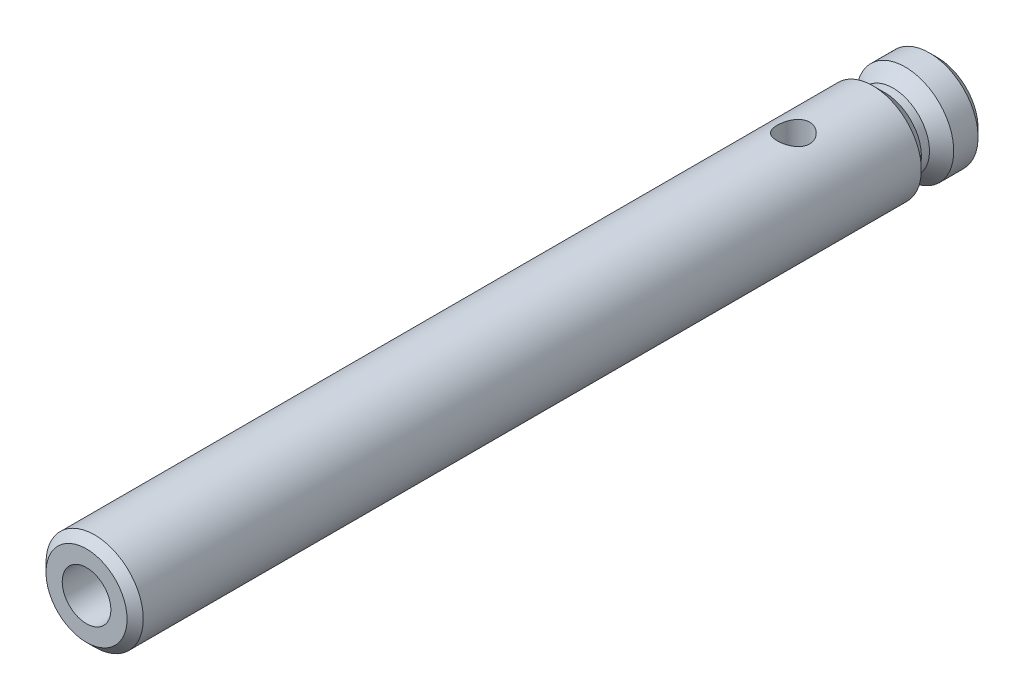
ISO-10303-21;
HEADER;
FILE_DESCRIPTION(('STEP AP214'),'2;1');
FILE_NAME('part.step','',(''),(''),'','','');
FILE_SCHEMA(('AUTOMOTIVE_DESIGN { 1 0 10303 214 1 1 1 1 }'));
ENDSEC;
DATA;
#1=APPLICATION_CONTEXT('core data for automotive mechanical design processes');
#2=APPLICATION_PROTOCOL_DEFINITION('international standard','automotive_design',2000,#1);
#3=PRODUCT_CONTEXT('',#1,'mechanical');
#4=PRODUCT('Part','Part','',(#3));
#5=PRODUCT_RELATED_PRODUCT_CATEGORY('part','',(#4));
#6=PRODUCT_DEFINITION_FORMATION('','',#4);
#7=PRODUCT_DEFINITION_CONTEXT('part definition',#1,'design');
#8=PRODUCT_DEFINITION('design','',#6,#7);
#9=PRODUCT_DEFINITION_SHAPE('','',#8);
#10=(LENGTH_UNIT() NAMED_UNIT(*) SI_UNIT(.MILLI.,.METRE.));
#11=(NAMED_UNIT(*) PLANE_ANGLE_UNIT() SI_UNIT($,.RADIAN.));
#12=(NAMED_UNIT(*) SI_UNIT($,.STERADIAN.) SOLID_ANGLE_UNIT());
#13=UNCERTAINTY_MEASURE_WITH_UNIT(LENGTH_MEASURE(1.E-05),#10,'distance_accuracy_value','');
#14=(GEOMETRIC_REPRESENTATION_CONTEXT(3) GLOBAL_UNCERTAINTY_ASSIGNED_CONTEXT((#13)) GLOBAL_UNIT_ASSIGNED_CONTEXT((#10,
#11,#12)) REPRESENTATION_CONTEXT('',''));
#15=CARTESIAN_POINT('',(0.,0.,0.));
#16=DIRECTION('',(0.,0.,1.));
#17=DIRECTION('',(1.,0.,0.));
#18=AXIS2_PLACEMENT_3D('',#15,#16,#17);
#19=CARTESIAN_POINT('',(0.,-185.427795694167,87.2095831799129));
#20=DIRECTION('',(0.,0.,-1.));
#21=DIRECTION('',(-1.,0.,0.));
#22=AXIS2_PLACEMENT_3D('',#19,#20,#21);
#23=CYLINDRICAL_SURFACE('',#22,3.);
#24=CARTESIAN_POINT('',(0.,-185.427795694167,72.2095831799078));
#25=DIRECTION('',(0.,0.,-1.));
#26=DIRECTION('',(-1.,0.,0.));
#27=AXIS2_PLACEMENT_3D('',#24,#25,#26);
#28=CIRCLE('',#27,3.);
#29=CARTESIAN_POINT('',(-3.,-185.427795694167,72.2095831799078));
#30=VERTEX_POINT('',#29);
#31=EDGE_CURVE('E55',#30,#30,#28,.T.);
#32=ORIENTED_EDGE('',*,*,#31,.T.);
#33=EDGE_LOOP('',(#32));
#34=FACE_BOUND('',#33,.T.);
#35=CARTESIAN_POINT('',(0.,-185.427795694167,87.2095831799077));
#36=DIRECTION('',(0.,0.,-1.));
#37=DIRECTION('',(-1.,0.,0.));
#38=AXIS2_PLACEMENT_3D('',#35,#36,#37);
#39=CIRCLE('',#38,3.);
#40=CARTESIAN_POINT('',(-3.,-185.427795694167,87.2095831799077));
#41=VERTEX_POINT('',#40);
#42=EDGE_CURVE('E117',#41,#41,#39,.T.);
#43=ORIENTED_EDGE('',*,*,#42,.F.);
#44=EDGE_LOOP('',(#43));
#45=FACE_BOUND('',#44,.T.);
#46=ADVANCED_FACE('F28',(#34,#45),#23,.F.);
#47=CARTESIAN_POINT('',(3.,-185.427795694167,87.2095831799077));
#48=DIRECTION('',(0.,0.,1.));
#49=DIRECTION('',(1.,0.,0.));
#50=AXIS2_PLACEMENT_3D('',#47,#48,#49);
#51=PLANE('',#50);
#52=CARTESIAN_POINT('',(0.,-185.427795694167,87.2095831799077));
#53=DIRECTION('',(0.,0.,1.));
#54=DIRECTION('',(1.,0.,0.));
#55=AXIS2_PLACEMENT_3D('',#52,#53,#54);
#56=CIRCLE('',#55,5.00000000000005);
#57=CARTESIAN_POINT('',(5.00000000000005,-185.427795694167,87.2095831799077));
#58=VERTEX_POINT('',#57);
#59=EDGE_CURVE('E10',#58,#58,#56,.T.);
#60=ORIENTED_EDGE('',*,*,#59,.T.);
#61=EDGE_LOOP('',(#60));
#62=FACE_BOUND('',#61,.T.);
#63=ORIENTED_EDGE('',*,*,#42,.T.);
#64=EDGE_LOOP('',(#63));
#65=FACE_BOUND('',#64,.T.);
#66=ADVANCED_FACE('F104',(#62,#65),#51,.T.);
#67=CARTESIAN_POINT('',(0.,-185.427795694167,87.2095831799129));
#68=DIRECTION('',(0.,0.,-1.));
#69=DIRECTION('',(-1.,0.,0.));
#70=AXIS2_PLACEMENT_3D('',#67,#68,#69);
#71=CYLINDRICAL_SURFACE('',#70,6.00000000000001);
#72=CARTESIAN_POINT('',(0.,-185.427795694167,86.2095831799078));
#73=DIRECTION('',(0.,0.,1.));
#74=DIRECTION('',(1.,0.,0.));
#75=AXIS2_PLACEMENT_3D('',#72,#73,#74);
#76=CIRCLE('',#75,6.00000000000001);
#77=CARTESIAN_POINT('',(6.00000000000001,-185.427795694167,86.2095831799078));
#78=VERTEX_POINT('',#77);
#79=EDGE_CURVE('E34',#78,#78,#76,.F.);
#80=ORIENTED_EDGE('',*,*,#79,.T.);
#81=EDGE_LOOP('',(#80));
#82=FACE_BOUND('',#81,.T.);
#83=CARTESIAN_POINT('',(0.,-179.427795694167,2.));
#84=CARTESIAN_POINT('',(0.109126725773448,-179.427795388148,2.00000050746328));
#85=CARTESIAN_POINT('',(0.218250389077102,-179.430800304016,1.99103946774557));
#86=CARTESIAN_POINT('',(0.433283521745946,-179.442491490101,1.95554178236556));
#87=CARTESIAN_POINT('',(0.539192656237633,-179.451178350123,1.92900331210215));
#88=CARTESIAN_POINT('',(0.744665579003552,-179.473289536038,1.8593615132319));
#89=CARTESIAN_POINT('',(0.844239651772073,-179.486705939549,1.81628587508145));
#90=CARTESIAN_POINT('',(1.03474987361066,-179.51690677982,1.7149176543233));
#91=CARTESIAN_POINT('',(1.12568431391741,-179.533691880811,1.6566220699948));
#92=CARTESIAN_POINT('',(1.29948335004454,-179.569513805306,1.52434839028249));
#93=CARTESIAN_POINT('',(1.38200740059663,-179.588604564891,1.449937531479));
#94=CARTESIAN_POINT('',(1.53366538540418,-179.626589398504,1.28846569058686));
#95=CARTESIAN_POINT('',(1.60279637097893,-179.645483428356,1.20140193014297));
#96=CARTESIAN_POINT('',(1.72764988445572,-179.681529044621,1.01402976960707));
#97=CARTESIAN_POINT('',(1.78292971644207,-179.698614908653,0.913412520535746));
#98=CARTESIAN_POINT('',(1.87563774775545,-179.728289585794,0.703647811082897));
#99=CARTESIAN_POINT('',(1.91307139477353,-179.740879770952,0.594502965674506));
#100=CARTESIAN_POINT('',(1.96774692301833,-179.759569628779,0.374653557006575));
#101=CARTESIAN_POINT('',(1.98562689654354,-179.765873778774,0.264125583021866));
#102=CARTESIAN_POINT('',(2.00268224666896,-179.771882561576,0.0414724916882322));
#103=CARTESIAN_POINT('',(2.00186340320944,-179.771589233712,-0.0706521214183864));
#104=CARTESIAN_POINT('',(1.98203980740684,-179.764615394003,-0.287873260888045));
#105=CARTESIAN_POINT('',(1.96386782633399,-179.758227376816,-0.393056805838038));
#106=CARTESIAN_POINT('',(1.91121232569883,-179.740262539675,-0.59878683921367));
#107=CARTESIAN_POINT('',(1.87672685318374,-179.728685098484,-0.699332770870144));
#108=CARTESIAN_POINT('',(1.79187811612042,-179.701437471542,-0.894825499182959));
#109=CARTESIAN_POINT('',(1.74126809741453,-179.685704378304,-0.989656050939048));
#110=CARTESIAN_POINT('',(1.62577821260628,-179.651944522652,-1.16974181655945));
#111=CARTESIAN_POINT('',(1.56089422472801,-179.633917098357,-1.25499425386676));
#112=CARTESIAN_POINT('',(1.41469866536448,-179.596449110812,-1.41818319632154));
#113=CARTESIAN_POINT('',(1.33270630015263,-179.57698390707,-1.49550538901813));
#114=CARTESIAN_POINT('',(1.15667913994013,-179.539656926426,-1.63546253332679));
#115=CARTESIAN_POINT('',(1.06264319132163,-179.521795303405,-1.69809607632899));
#116=CARTESIAN_POINT('',(0.863895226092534,-179.489453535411,-1.80739260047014));
#117=CARTESIAN_POINT('',(0.759086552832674,-179.475008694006,-1.85389098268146));
#118=CARTESIAN_POINT('',(0.542538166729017,-179.451384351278,-1.92840634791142));
#119=CARTESIAN_POINT('',(0.430800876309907,-179.442203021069,-1.95642975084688));
#120=CARTESIAN_POINT('',(0.208767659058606,-179.430443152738,-1.99211133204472));
#121=CARTESIAN_POINT('',(0.0986191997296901,-179.427595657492,-2.0005996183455));
#122=CARTESIAN_POINT('',(-0.121550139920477,-179.42801764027,-1.99933465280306));
#123=CARTESIAN_POINT('',(-0.231571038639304,-179.431286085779,-1.98958448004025));
#124=CARTESIAN_POINT('',(-0.445039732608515,-179.443395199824,-1.95277618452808));
#125=CARTESIAN_POINT('',(-0.548585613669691,-179.452071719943,-1.92622758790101));
#126=CARTESIAN_POINT('',(-0.749711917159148,-179.473958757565,-1.85721311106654));
#127=CARTESIAN_POINT('',(-0.847291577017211,-179.487169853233,-1.81474520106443));
#128=CARTESIAN_POINT('',(-1.03657659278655,-179.517217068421,-1.71385913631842));
#129=CARTESIAN_POINT('',(-1.1280599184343,-179.534139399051,-1.65505081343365));
#130=CARTESIAN_POINT('',(-1.30012966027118,-179.569690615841,-1.52361169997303));
#131=CARTESIAN_POINT('',(-1.38071273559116,-179.58832002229,-1.45097668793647));
#132=CARTESIAN_POINT('',(-1.5325050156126,-179.626258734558,-1.29004249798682));
#133=CARTESIAN_POINT('',(-1.60312193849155,-179.645560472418,-1.20118154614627));
#134=CARTESIAN_POINT('',(-1.72851504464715,-179.681796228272,-1.01245686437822));
#135=CARTESIAN_POINT('',(-1.78329109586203,-179.698730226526,-0.912593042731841));
#136=CARTESIAN_POINT('',(-1.87519386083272,-179.728147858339,-0.704653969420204));
#137=CARTESIAN_POINT('',(-1.91235626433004,-179.740640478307,-0.596595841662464));
#138=CARTESIAN_POINT('',(-1.96778933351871,-179.759579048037,-0.375242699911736));
#139=CARTESIAN_POINT('',(-1.98606850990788,-179.766027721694,-0.2619500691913));
#140=CARTESIAN_POINT('',(-2.00255256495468,-179.771838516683,-0.0396058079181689));
#141=CARTESIAN_POINT('',(-2.0017405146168,-179.771547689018,0.0693646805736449));
#142=CARTESIAN_POINT('',(-1.98248458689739,-179.764770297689,0.285530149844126));
#143=CARTESIAN_POINT('',(-1.96404175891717,-179.758284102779,0.39272523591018));
#144=CARTESIAN_POINT('',(-1.91074362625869,-179.740105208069,0.600271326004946));
#145=CARTESIAN_POINT('',(-1.87620669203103,-179.728513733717,0.70071365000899));
#146=CARTESIAN_POINT('',(-1.7919587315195,-179.701467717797,0.894454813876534));
#147=CARTESIAN_POINT('',(-1.74224433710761,-179.686012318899,0.987752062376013));
#148=CARTESIAN_POINT('',(-1.62652138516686,-179.652139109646,1.16896733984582));
#149=CARTESIAN_POINT('',(-1.55989648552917,-179.633621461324,1.25647300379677));
#150=CARTESIAN_POINT('',(-1.4132857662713,-179.596128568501,1.4193796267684));
#151=CARTESIAN_POINT('',(-1.33329616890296,-179.577153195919,1.49477715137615));
#152=CARTESIAN_POINT('',(-1.15848311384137,-179.539995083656,1.63428882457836));
#153=CARTESIAN_POINT('',(-1.06320302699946,-179.521872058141,1.697848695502));
#154=CARTESIAN_POINT('',(-0.862714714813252,-179.489275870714,1.80798085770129));
#155=CARTESIAN_POINT('',(-0.757509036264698,-179.474801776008,1.85455749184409));
#156=CARTESIAN_POINT('',(-0.544987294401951,-179.451685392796,1.92744326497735));
#157=CARTESIAN_POINT('',(-0.437975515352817,-179.442811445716,1.95456493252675));
#158=CARTESIAN_POINT('',(-0.220640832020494,-179.430867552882,1.99084056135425));
#159=CARTESIAN_POINT('',(-0.110318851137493,-179.427796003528,1.99999948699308));
#160=CARTESIAN_POINT('',(0.,-179.427795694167,2.));
#161=B_SPLINE_CURVE_WITH_KNOTS('',3,(#83,#84,#85,#86,#87,#88,#89,#90,#91,#92,#93,#94,#95,#96,
#97,#98,#99,#100,#101,#102,#103,#104,#105,#106,#107,#108,#109,#110,#111,#112,#113,#114,#115,
#116,#117,#118,#119,#120,#121,#122,#123,#124,#125,#126,#127,#128,#129,#130,#131,#132,#133,#134,
#135,#136,#137,#138,#139,#140,#141,#142,#143,#144,#145,#146,#147,#148,#149,#150,#151,#152,#153,
#154,#155,#156,#157,#158,#159,#160),.UNSPECIFIED.,.T.,.F.,(4,2,2,2,2,2,2,2,2,2,2,2,2,2,2,2,2,2,
2,2,2,2,2,2,2,2,2,2,2,2,2,2,2,2,2,2,2,2,4),(0.,0.326974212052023,0.653982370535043,
0.980445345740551,1.30697275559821,1.64369368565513,1.98048866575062,2.32696769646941,
2.67334089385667,3.00803851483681,3.34263267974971,3.66193653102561,3.98127861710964,
4.30576342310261,4.63034205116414,4.97186611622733,5.31342291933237,5.65836811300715,
6.00319337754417,6.3330716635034,6.66289426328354,6.98316315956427,7.30347290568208,
7.63220799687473,7.96104361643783,8.30482045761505,8.64860016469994,8.99168027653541,
9.3346056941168,9.65991332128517,9.98520158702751,10.3043117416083,10.6234927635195,
10.9566013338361,11.2898042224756,11.635993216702,11.9820936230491,12.3127311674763,
12.6432773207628),.UNSPECIFIED.);
#162=CARTESIAN_POINT('',(0.,-179.427795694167,2.));
#163=VERTEX_POINT('',#162);
#164=EDGE_CURVE('E48',#163,#163,#161,.T.);
#165=ORIENTED_EDGE('',*,*,#164,.F.);
#166=EDGE_LOOP('',(#165));
#167=FACE_BOUND('',#166,.T.);
#168=CARTESIAN_POINT('',(0.,-191.427795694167,1.99999999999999));
#169=CARTESIAN_POINT('',(-0.109126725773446,-191.427796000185,2.00000050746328));
#170=CARTESIAN_POINT('',(-0.218250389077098,-191.424791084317,1.99103946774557));
#171=CARTESIAN_POINT('',(-0.433283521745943,-191.413099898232,1.95554178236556));
#172=CARTESIAN_POINT('',(-0.539192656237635,-191.40441303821,1.92900331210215));
#173=CARTESIAN_POINT('',(-0.744665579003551,-191.382301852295,1.8593615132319));
#174=CARTESIAN_POINT('',(-0.844239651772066,-191.368885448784,1.81628587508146));
#175=CARTESIAN_POINT('',(-1.03474987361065,-191.338684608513,1.71491765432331));
#176=CARTESIAN_POINT('',(-1.12568431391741,-191.321899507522,1.6566220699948));
#177=CARTESIAN_POINT('',(-1.29948335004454,-191.286077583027,1.52434839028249));
#178=CARTESIAN_POINT('',(-1.38200740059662,-191.266986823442,1.44993753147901));
#179=CARTESIAN_POINT('',(-1.53366538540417,-191.229001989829,1.28846569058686));
#180=CARTESIAN_POINT('',(-1.60279637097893,-191.210107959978,1.20140193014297));
#181=CARTESIAN_POINT('',(-1.72764988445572,-191.174062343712,1.01402976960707));
#182=CARTESIAN_POINT('',(-1.78292971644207,-191.15697647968,0.91341252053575));
#183=CARTESIAN_POINT('',(-1.87563774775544,-191.127301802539,0.7036478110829));
#184=CARTESIAN_POINT('',(-1.91307139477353,-191.114711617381,0.594502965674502));
#185=CARTESIAN_POINT('',(-1.96774692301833,-191.096021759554,0.374653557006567));
#186=CARTESIAN_POINT('',(-1.98562689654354,-191.089717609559,0.264125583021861));
#187=CARTESIAN_POINT('',(-2.00268224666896,-191.083708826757,0.0414724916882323));
#188=CARTESIAN_POINT('',(-2.00186340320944,-191.084002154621,-0.0706521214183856));
#189=CARTESIAN_POINT('',(-1.98203980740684,-191.09097599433,-0.287873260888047));
#190=CARTESIAN_POINT('',(-1.96386782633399,-191.097364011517,-0.393056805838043));
#191=CARTESIAN_POINT('',(-1.91121232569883,-191.115328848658,-0.598786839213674));
#192=CARTESIAN_POINT('',(-1.87672685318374,-191.126906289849,-0.699332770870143));
#193=CARTESIAN_POINT('',(-1.79187811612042,-191.154153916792,-0.89482549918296));
#194=CARTESIAN_POINT('',(-1.74126809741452,-191.169887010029,-0.989656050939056));
#195=CARTESIAN_POINT('',(-1.62577821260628,-191.203646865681,-1.16974181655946));
#196=CARTESIAN_POINT('',(-1.56089422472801,-191.221674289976,-1.25499425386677));
#197=CARTESIAN_POINT('',(-1.41469866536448,-191.259142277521,-1.41818319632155));
#198=CARTESIAN_POINT('',(-1.33270630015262,-191.278607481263,-1.49550538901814));
#199=CARTESIAN_POINT('',(-1.15667913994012,-191.315934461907,-1.6354625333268));
#200=CARTESIAN_POINT('',(-1.06264319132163,-191.333796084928,-1.698096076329));
#201=CARTESIAN_POINT('',(-0.863895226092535,-191.366137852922,-1.80739260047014));
#202=CARTESIAN_POINT('',(-0.759086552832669,-191.380582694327,-1.85389098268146));
#203=CARTESIAN_POINT('',(-0.542538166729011,-191.404207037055,-1.92840634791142));
#204=CARTESIAN_POINT('',(-0.430800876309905,-191.413388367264,-1.95642975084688));
#205=CARTESIAN_POINT('',(-0.208767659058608,-191.425148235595,-1.99211133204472));
#206=CARTESIAN_POINT('',(-0.0986191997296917,-191.427995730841,-2.0005996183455));
#207=CARTESIAN_POINT('',(0.121550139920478,-191.427573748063,-1.99933465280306));
#208=CARTESIAN_POINT('',(0.231571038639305,-191.424305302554,-1.98958448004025));
#209=CARTESIAN_POINT('',(0.445039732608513,-191.412196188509,-1.95277618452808));
#210=CARTESIAN_POINT('',(0.548585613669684,-191.40351966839,-1.92622758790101));
#211=CARTESIAN_POINT('',(0.749711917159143,-191.381632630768,-1.85721311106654));
#212=CARTESIAN_POINT('',(0.847291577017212,-191.3684215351,-1.81474520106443));
#213=CARTESIAN_POINT('',(1.03657659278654,-191.338374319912,-1.71385913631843));
#214=CARTESIAN_POINT('',(1.12805991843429,-191.321451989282,-1.65505081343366));
#215=CARTESIAN_POINT('',(1.30012966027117,-191.285900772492,-1.52361169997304));
#216=CARTESIAN_POINT('',(1.38071273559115,-191.267271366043,-1.45097668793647));
#217=CARTESIAN_POINT('',(1.5325050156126,-191.229332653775,-1.29004249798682));
#218=CARTESIAN_POINT('',(1.60312193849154,-191.210030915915,-1.20118154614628));
#219=CARTESIAN_POINT('',(1.72851504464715,-191.173795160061,-1.01245686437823));
#220=CARTESIAN_POINT('',(1.78329109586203,-191.156861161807,-0.912593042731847));
#221=CARTESIAN_POINT('',(1.87519386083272,-191.127443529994,-0.704653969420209));
#222=CARTESIAN_POINT('',(1.91235626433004,-191.114950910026,-0.596595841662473));
#223=CARTESIAN_POINT('',(1.96778933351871,-191.096012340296,-0.375242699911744));
#224=CARTESIAN_POINT('',(1.98606850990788,-191.089563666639,-0.261950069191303));
#225=CARTESIAN_POINT('',(2.00255256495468,-191.08375287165,-0.039605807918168));
#226=CARTESIAN_POINT('',(2.0017405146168,-191.084043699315,0.0693646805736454));
#227=CARTESIAN_POINT('',(1.98248458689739,-191.090821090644,0.285530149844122));
#228=CARTESIAN_POINT('',(1.96404175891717,-191.097307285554,0.392725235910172));
#229=CARTESIAN_POINT('',(1.91074362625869,-191.115486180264,0.600271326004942));
#230=CARTESIAN_POINT('',(1.87620669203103,-191.127077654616,0.700713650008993));
#231=CARTESIAN_POINT('',(1.79195873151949,-191.154123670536,0.894454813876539));
#232=CARTESIAN_POINT('',(1.74224433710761,-191.169579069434,0.987752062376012));
#233=CARTESIAN_POINT('',(1.62652138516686,-191.203452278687,1.16896733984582));
#234=CARTESIAN_POINT('',(1.55989648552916,-191.221969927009,1.25647300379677));
#235=CARTESIAN_POINT('',(1.41328576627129,-191.259462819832,1.4193796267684));
#236=CARTESIAN_POINT('',(1.33329616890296,-191.278438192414,1.49477715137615));
#237=CARTESIAN_POINT('',(1.15848311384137,-191.315596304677,1.63428882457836));
#238=CARTESIAN_POINT('',(1.06320302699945,-191.333719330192,1.697848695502));
#239=CARTESIAN_POINT('',(0.862714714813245,-191.366315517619,1.8079808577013));
#240=CARTESIAN_POINT('',(0.757509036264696,-191.380789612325,1.85455749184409));
#241=CARTESIAN_POINT('',(0.544987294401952,-191.403905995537,1.92744326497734));
#242=CARTESIAN_POINT('',(0.437975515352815,-191.412779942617,1.95456493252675));
#243=CARTESIAN_POINT('',(0.220640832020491,-191.424723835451,1.99084056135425));
#244=CARTESIAN_POINT('',(0.110318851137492,-191.427795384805,1.99999948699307));
#245=CARTESIAN_POINT('',(0.,-191.427795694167,1.99999999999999));
#246=B_SPLINE_CURVE_WITH_KNOTS('',3,(#168,#169,#170,#171,#172,#173,#174,#175,#176,#177,#178,
#179,#180,#181,#182,#183,#184,#185,#186,#187,#188,#189,#190,#191,#192,#193,#194,#195,#196,#197,
#198,#199,#200,#201,#202,#203,#204,#205,#206,#207,#208,#209,#210,#211,#212,#213,#214,#215,#216,
#217,#218,#219,#220,#221,#222,#223,#224,#225,#226,#227,#228,#229,#230,#231,#232,#233,#234,#235,
#236,#237,#238,#239,#240,#241,#242,#243,#244,#245),.UNSPECIFIED.,.T.,.F.,(4,2,2,2,2,2,2,2,2,2,2,
2,2,2,2,2,2,2,2,2,2,2,2,2,2,2,2,2,2,2,2,2,2,2,2,2,2,2,4),(0.,0.326974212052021,
0.653982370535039,0.980445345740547,1.3069727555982,1.64369368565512,1.98048866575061,
2.32696769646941,2.67334089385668,3.00803851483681,3.34263267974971,3.66193653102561,
3.98127861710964,4.30576342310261,4.63034205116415,4.97186611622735,5.31342291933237,
5.65836811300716,6.00319337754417,6.3330716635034,6.66289426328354,6.98316315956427,
7.30347290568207,7.63220799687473,7.96104361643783,8.30482045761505,8.64860016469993,
8.99168027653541,9.3346056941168,9.65991332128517,9.98520158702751,10.3043117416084,
10.6234927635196,10.9566013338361,11.2898042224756,11.635993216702,11.9820936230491,
12.3127311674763,12.6432773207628),.UNSPECIFIED.);
#247=CARTESIAN_POINT('',(0.,-191.427795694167,1.99999999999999));
#248=VERTEX_POINT('',#247);
#249=EDGE_CURVE('E47',#248,#248,#246,.T.);
#250=ORIENTED_EDGE('',*,*,#249,.F.);
#251=EDGE_LOOP('',(#250));
#252=FACE_BOUND('',#251,.T.);
#253=CARTESIAN_POINT('',(0.,-185.427795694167,-9.79041682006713));
#254=DIRECTION('',(0.,0.,-1.));
#255=DIRECTION('',(-1.,0.,0.));
#256=AXIS2_PLACEMENT_3D('',#253,#254,#255);
#257=CIRCLE('',#256,6.00000000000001);
#258=CARTESIAN_POINT('',(-6.00000000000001,-185.427795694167,-9.79041682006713));
#259=VERTEX_POINT('',#258);
#260=EDGE_CURVE('E119',#259,#259,#257,.T.);
#261=ORIENTED_EDGE('',*,*,#260,.F.);
#262=EDGE_LOOP('',(#261));
#263=FACE_BOUND('',#262,.T.);
#264=ADVANCED_FACE('F59',(#82,#167,#252,#263),#71,.T.);
#265=CARTESIAN_POINT('',(0.,-185.427795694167,-11.2904168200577));
#266=DIRECTION('',(0.,0.,1.));
#267=DIRECTION('',(1.,0.,0.));
#268=AXIS2_PLACEMENT_3D('',#265,#266,#267);
#269=CONICAL_SURFACE('',#268,4.50000000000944,0.785398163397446);
#270=ORIENTED_EDGE('',*,*,#260,.T.);
#271=EDGE_LOOP('',(#270));
#272=FACE_BOUND('',#271,.T.);
#273=CARTESIAN_POINT('',(0.,-185.427795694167,-11.2904168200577));
#274=DIRECTION('',(0.,0.,-1.));
#275=DIRECTION('',(-1.,0.,0.));
#276=AXIS2_PLACEMENT_3D('',#273,#274,#275);
#277=CIRCLE('',#276,4.50000000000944);
#278=CARTESIAN_POINT('',(-4.50000000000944,-185.427795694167,-11.2904168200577));
#279=VERTEX_POINT('',#278);
#280=EDGE_CURVE('E121',#279,#279,#277,.T.);
#281=ORIENTED_EDGE('',*,*,#280,.F.);
#282=EDGE_LOOP('',(#281));
#283=FACE_BOUND('',#282,.T.);
#284=ADVANCED_FACE('F97',(#272,#283),#269,.T.);
#285=CARTESIAN_POINT('',(0.,-185.427795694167,87.2095831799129));
#286=DIRECTION('',(0.,0.,-1.));
#287=DIRECTION('',(-1.,0.,0.));
#288=AXIS2_PLACEMENT_3D('',#285,#286,#287);
#289=CYLINDRICAL_SURFACE('',#288,4.50000000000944);
#290=ORIENTED_EDGE('',*,*,#280,.T.);
#291=EDGE_LOOP('',(#290));
#292=FACE_BOUND('',#291,.T.);
#293=CARTESIAN_POINT('',(0.,-185.427795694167,-12.2904168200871));
#294=DIRECTION('',(0.,0.,-1.));
#295=DIRECTION('',(-1.,0.,0.));
#296=AXIS2_PLACEMENT_3D('',#293,#294,#295);
#297=CIRCLE('',#296,4.50000000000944);
#298=CARTESIAN_POINT('',(-4.50000000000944,-185.427795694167,-12.2904168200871));
#299=VERTEX_POINT('',#298);
#300=EDGE_CURVE('E126',#299,#299,#297,.T.);
#301=ORIENTED_EDGE('',*,*,#300,.F.);
#302=EDGE_LOOP('',(#301));
#303=FACE_BOUND('',#302,.T.);
#304=ADVANCED_FACE('F94',(#292,#303),#289,.T.);
#305=CARTESIAN_POINT('',(0.,-185.427795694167,-13.7904168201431));
#306=DIRECTION('',(0.,0.,-1.));
#307=DIRECTION('',(-1.,0.,0.));
#308=AXIS2_PLACEMENT_3D('',#305,#306,#307);
#309=CONICAL_SURFACE('',#308,6.00000000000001,0.785398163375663);
#310=ORIENTED_EDGE('',*,*,#300,.T.);
#311=EDGE_LOOP('',(#310));
#312=FACE_BOUND('',#311,.T.);
#313=CARTESIAN_POINT('',(0.,-185.427795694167,-13.7904168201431));
#314=DIRECTION('',(0.,0.,-1.));
#315=DIRECTION('',(-1.,0.,0.));
#316=AXIS2_PLACEMENT_3D('',#313,#314,#315);
#317=CIRCLE('',#316,6.00000000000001);
#318=CARTESIAN_POINT('',(-6.00000000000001,-185.427795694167,-13.7904168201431));
#319=VERTEX_POINT('',#318);
#320=EDGE_CURVE('E129',#319,#319,#317,.T.);
#321=ORIENTED_EDGE('',*,*,#320,.F.);
#322=EDGE_LOOP('',(#321));
#323=FACE_BOUND('',#322,.T.);
#324=ADVANCED_FACE('F90',(#312,#323),#309,.T.);
#325=CARTESIAN_POINT('',(0.,-185.427795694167,87.2095831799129));
#326=DIRECTION('',(0.,0.,-1.));
#327=DIRECTION('',(-1.,0.,0.));
#328=AXIS2_PLACEMENT_3D('',#325,#326,#327);
#329=CYLINDRICAL_SURFACE('',#328,6.00000000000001);
#330=CARTESIAN_POINT('',(0.,-185.427795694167,-16.7904168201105));
#331=DIRECTION('',(0.,0.,-1.));
#332=DIRECTION('',(-1.,0.,0.));
#333=AXIS2_PLACEMENT_3D('',#330,#331,#332);
#334=CIRCLE('',#333,6.00000000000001);
#335=CARTESIAN_POINT('',(-6.00000000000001,-185.427795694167,-16.7904168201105));
#336=VERTEX_POINT('',#335);
#337=EDGE_CURVE('E38',#336,#336,#334,.F.);
#338=ORIENTED_EDGE('',*,*,#337,.T.);
#339=EDGE_LOOP('',(#338));
#340=FACE_BOUND('',#339,.T.);
#341=ORIENTED_EDGE('',*,*,#320,.T.);
#342=EDGE_LOOP('',(#341));
#343=FACE_BOUND('',#342,.T.);
#344=ADVANCED_FACE('F86',(#340,#343),#329,.T.);
#345=CARTESIAN_POINT('',(3.,-185.427795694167,-17.7904168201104));
#346=DIRECTION('',(0.,0.,-1.));
#347=DIRECTION('',(-1.,0.,0.));
#348=AXIS2_PLACEMENT_3D('',#345,#346,#347);
#349=PLANE('',#348);
#350=CARTESIAN_POINT('',(0.,-185.427795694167,-17.7904168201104));
#351=DIRECTION('',(0.,0.,-1.));
#352=DIRECTION('',(-1.,0.,0.));
#353=AXIS2_PLACEMENT_3D('',#350,#351,#352);
#354=CIRCLE('',#353,5.00000000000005);
#355=CARTESIAN_POINT('',(-5.00000000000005,-185.427795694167,-17.7904168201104));
#356=VERTEX_POINT('',#355);
#357=EDGE_CURVE('E42',#356,#356,#354,.T.);
#358=ORIENTED_EDGE('',*,*,#357,.T.);
#359=EDGE_LOOP('',(#358));
#360=FACE_BOUND('',#359,.T.);
#361=CARTESIAN_POINT('',(0.,-185.427795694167,-17.7904168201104));
#362=DIRECTION('',(0.,0.,-1.));
#363=DIRECTION('',(-1.,0.,0.));
#364=AXIS2_PLACEMENT_3D('',#361,#362,#363);
#365=CIRCLE('',#364,3.);
#366=CARTESIAN_POINT('',(-3.,-185.427795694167,-17.7904168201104));
#367=VERTEX_POINT('',#366);
#368=EDGE_CURVE('E132',#367,#367,#365,.T.);
#369=ORIENTED_EDGE('',*,*,#368,.F.);
#370=EDGE_LOOP('',(#369));
#371=FACE_BOUND('',#370,.T.);
#372=ADVANCED_FACE('F82',(#360,#371),#349,.T.);
#373=CARTESIAN_POINT('',(0.,-185.427795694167,87.2095831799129));
#374=DIRECTION('',(0.,0.,-1.));
#375=DIRECTION('',(-1.,0.,0.));
#376=AXIS2_PLACEMENT_3D('',#373,#374,#375);
#377=CYLINDRICAL_SURFACE('',#376,3.);
#378=ORIENTED_EDGE('',*,*,#368,.T.);
#379=EDGE_LOOP('',(#378));
#380=FACE_BOUND('',#379,.T.);
#381=CARTESIAN_POINT('',(0.,-185.427795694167,-2.79041682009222));
#382=DIRECTION('',(0.,0.,-1.));
#383=DIRECTION('',(-1.,0.,0.));
#384=AXIS2_PLACEMENT_3D('',#381,#382,#383);
#385=CIRCLE('',#384,3.);
#386=CARTESIAN_POINT('',(-3.,-185.427795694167,-2.79041682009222));
#387=VERTEX_POINT('',#386);
#388=EDGE_CURVE('E135',#387,#387,#385,.T.);
#389=ORIENTED_EDGE('',*,*,#388,.F.);
#390=EDGE_LOOP('',(#389));
#391=FACE_BOUND('',#390,.T.);
#392=ADVANCED_FACE('F78',(#380,#391),#377,.F.);
#393=CARTESIAN_POINT('',(0.,-185.427795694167,-2.79041682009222));
#394=DIRECTION('',(0.,0.,-1.));
#395=DIRECTION('',(-1.,0.,0.));
#396=AXIS2_PLACEMENT_3D('',#393,#394,#395);
#397=PLANE('',#396);
#398=ORIENTED_EDGE('',*,*,#388,.T.);
#399=EDGE_LOOP('',(#398));
#400=FACE_BOUND('',#399,.T.);
#401=ADVANCED_FACE('F74',(#400),#397,.T.);
#402=CARTESIAN_POINT('',(3.,-185.427795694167,72.2095831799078));
#403=DIRECTION('',(0.,0.,1.));
#404=DIRECTION('',(1.,0.,0.));
#405=AXIS2_PLACEMENT_3D('',#402,#403,#404);
#406=PLANE('',#405);
#407=ORIENTED_EDGE('',*,*,#31,.F.);
#408=EDGE_LOOP('',(#407));
#409=FACE_BOUND('',#408,.T.);
#410=ADVANCED_FACE('F68',(#409),#406,.T.);
#411=CARTESIAN_POINT('',(0.,-191.427795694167,0.));
#412=DIRECTION('',(0.,1.,0.));
#413=DIRECTION('',(0.,0.,1.));
#414=AXIS2_PLACEMENT_3D('',#411,#412,#413);
#415=CYLINDRICAL_SURFACE('',#414,2.);
#416=ORIENTED_EDGE('',*,*,#249,.T.);
#417=EDGE_LOOP('',(#416));
#418=FACE_BOUND('',#417,.T.);
#419=ORIENTED_EDGE('',*,*,#164,.T.);
#420=EDGE_LOOP('',(#419));
#421=FACE_BOUND('',#420,.T.);
#422=ADVANCED_FACE('F62',(#418,#421),#415,.F.);
#423=CARTESIAN_POINT('',(0.,-185.427795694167,-17.7904168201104));
#424=DIRECTION('',(0.,0.,1.));
#425=DIRECTION('',(1.,0.,0.));
#426=AXIS2_PLACEMENT_3D('',#423,#424,#425);
#427=CONICAL_SURFACE('',#426,5.00000000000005,0.785398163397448);
#428=ORIENTED_EDGE('',*,*,#337,.F.);
#429=EDGE_LOOP('',(#428));
#430=FACE_BOUND('',#429,.T.);
#431=ORIENTED_EDGE('',*,*,#357,.F.);
#432=EDGE_LOOP('',(#431));
#433=FACE_BOUND('',#432,.T.);
#434=ADVANCED_FACE('F67',(#430,#433),#427,.T.);
#435=CARTESIAN_POINT('',(0.,-185.427795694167,86.2095831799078));
#436=DIRECTION('',(0.,0.,-1.));
#437=DIRECTION('',(-1.,0.,0.));
#438=AXIS2_PLACEMENT_3D('',#435,#436,#437);
#439=CONICAL_SURFACE('',#438,6.00000000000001,0.785398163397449);
#440=ORIENTED_EDGE('',*,*,#59,.F.);
#441=EDGE_LOOP('',(#440));
#442=FACE_BOUND('',#441,.T.);
#443=ORIENTED_EDGE('',*,*,#79,.F.);
#444=EDGE_LOOP('',(#443));
#445=FACE_BOUND('',#444,.T.);
#446=ADVANCED_FACE('F222',(#442,#445),#439,.T.);
#447=CLOSED_SHELL('',(#46,#66,#264,#284,#304,#324,#344,#372,#392,#401,#410,#422,#434,#446));
#448=MANIFOLD_SOLID_BREP('B2',#447);
#449=ADVANCED_BREP_SHAPE_REPRESENTATION('',(#18,#448),#14);
#450=SHAPE_DEFINITION_REPRESENTATION(#9,#449);
ENDSEC;
END-ISO-10303-21;
